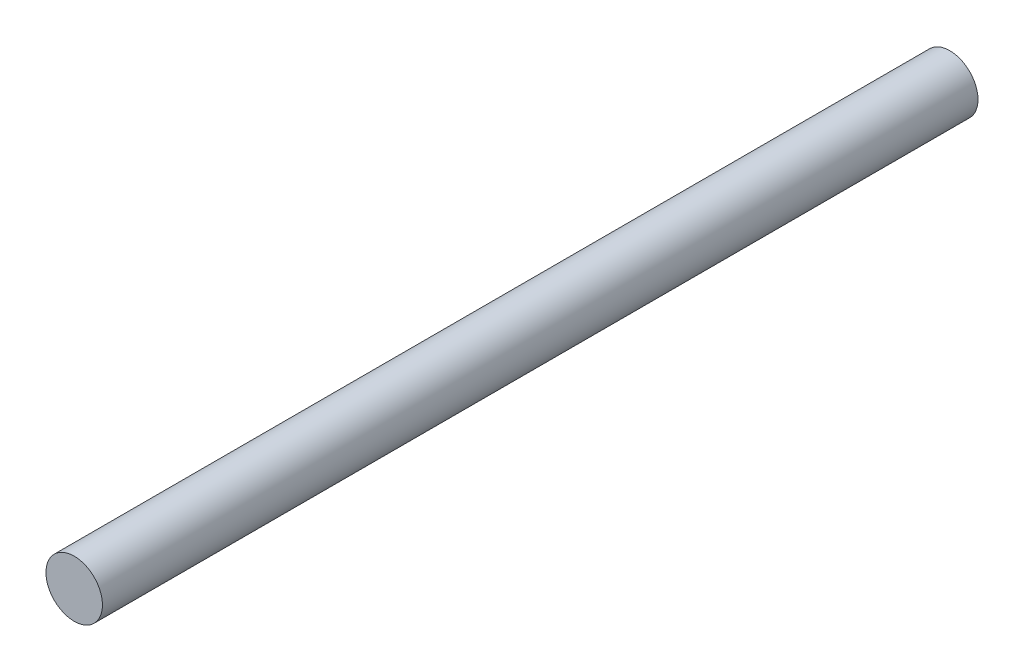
ISO-10303-21;
HEADER;
FILE_DESCRIPTION(('STEP AP214'),'2;1');
FILE_NAME('part.step','',(''),(''),'','','');
FILE_SCHEMA(('AUTOMOTIVE_DESIGN { 1 0 10303 214 1 1 1 1 }'));
ENDSEC;
DATA;
#1=APPLICATION_CONTEXT('core data for automotive mechanical design processes');
#2=APPLICATION_PROTOCOL_DEFINITION('international standard','automotive_design',2000,#1);
#3=PRODUCT_CONTEXT('',#1,'mechanical');
#4=PRODUCT('Part','Part','',(#3));
#5=PRODUCT_RELATED_PRODUCT_CATEGORY('part','',(#4));
#6=PRODUCT_DEFINITION_FORMATION('','',#4);
#7=PRODUCT_DEFINITION_CONTEXT('part definition',#1,'design');
#8=PRODUCT_DEFINITION('design','',#6,#7);
#9=PRODUCT_DEFINITION_SHAPE('','',#8);
#10=(LENGTH_UNIT() NAMED_UNIT(*) SI_UNIT(.MILLI.,.METRE.));
#11=(NAMED_UNIT(*) PLANE_ANGLE_UNIT() SI_UNIT($,.RADIAN.));
#12=(NAMED_UNIT(*) SI_UNIT($,.STERADIAN.) SOLID_ANGLE_UNIT());
#13=UNCERTAINTY_MEASURE_WITH_UNIT(LENGTH_MEASURE(1.E-05),#10,'distance_accuracy_value','');
#14=(GEOMETRIC_REPRESENTATION_CONTEXT(3) GLOBAL_UNCERTAINTY_ASSIGNED_CONTEXT((#13)) GLOBAL_UNIT_ASSIGNED_CONTEXT((#10,
#11,#12)) REPRESENTATION_CONTEXT('',''));
#15=CARTESIAN_POINT('',(0.,0.,0.));
#16=DIRECTION('',(0.,0.,1.));
#17=DIRECTION('',(1.,0.,0.));
#18=AXIS2_PLACEMENT_3D('',#15,#16,#17);
#19=CARTESIAN_POINT('',(-51.908663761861,20.029973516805,98.425));
#20=DIRECTION('',(0.,0.,-1.));
#21=DIRECTION('',(-1.,0.,0.));
#22=AXIS2_PLACEMENT_3D('',#19,#20,#21);
#23=CYLINDRICAL_SURFACE('',#22,3.175);
#24=CARTESIAN_POINT('',(-51.908663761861,20.029973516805,98.425));
#25=DIRECTION('',(0.,0.,1.));
#26=DIRECTION('',(1.,0.,0.));
#27=AXIS2_PLACEMENT_3D('',#24,#25,#26);
#28=CIRCLE('',#27,3.175);
#29=CARTESIAN_POINT('',(-48.733663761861,20.029973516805,98.425));
#30=VERTEX_POINT('',#29);
#31=EDGE_CURVE('E10',#30,#30,#28,.T.);
#32=ORIENTED_EDGE('',*,*,#31,.F.);
#33=EDGE_LOOP('',(#32));
#34=FACE_BOUND('',#33,.T.);
#35=CARTESIAN_POINT('',(-51.908663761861,20.029973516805,0.));
#36=DIRECTION('',(0.,0.,1.));
#37=DIRECTION('',(1.,0.,0.));
#38=AXIS2_PLACEMENT_3D('',#35,#36,#37);
#39=CIRCLE('',#38,3.175);
#40=CARTESIAN_POINT('',(-48.733663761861,20.029973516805,0.));
#41=VERTEX_POINT('',#40);
#42=EDGE_CURVE('E34',#41,#41,#39,.T.);
#43=ORIENTED_EDGE('',*,*,#42,.T.);
#44=EDGE_LOOP('',(#43));
#45=FACE_BOUND('',#44,.T.);
#46=ADVANCED_FACE('F31',(#34,#45),#23,.T.);
#47=CARTESIAN_POINT('',(-51.908663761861,20.029973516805,98.425));
#48=DIRECTION('',(0.,0.,1.));
#49=DIRECTION('',(1.,0.,0.));
#50=AXIS2_PLACEMENT_3D('',#47,#48,#49);
#51=PLANE('',#50);
#52=ORIENTED_EDGE('',*,*,#31,.T.);
#53=EDGE_LOOP('',(#52));
#54=FACE_BOUND('',#53,.T.);
#55=ADVANCED_FACE('F46',(#54),#51,.T.);
#56=CARTESIAN_POINT('',(-51.908663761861,20.029973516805,0.));
#57=DIRECTION('',(0.,0.,1.));
#58=DIRECTION('',(1.,0.,0.));
#59=AXIS2_PLACEMENT_3D('',#56,#57,#58);
#60=PLANE('',#59);
#61=ORIENTED_EDGE('',*,*,#42,.F.);
#62=EDGE_LOOP('',(#61));
#63=FACE_BOUND('',#62,.T.);
#64=ADVANCED_FACE('F44',(#63),#60,.F.);
#65=CLOSED_SHELL('',(#46,#55,#64));
#66=MANIFOLD_SOLID_BREP('B2',#65);
#67=ADVANCED_BREP_SHAPE_REPRESENTATION('',(#18,#66),#14);
#68=SHAPE_DEFINITION_REPRESENTATION(#9,#67);
ENDSEC;
END-ISO-10303-21;
